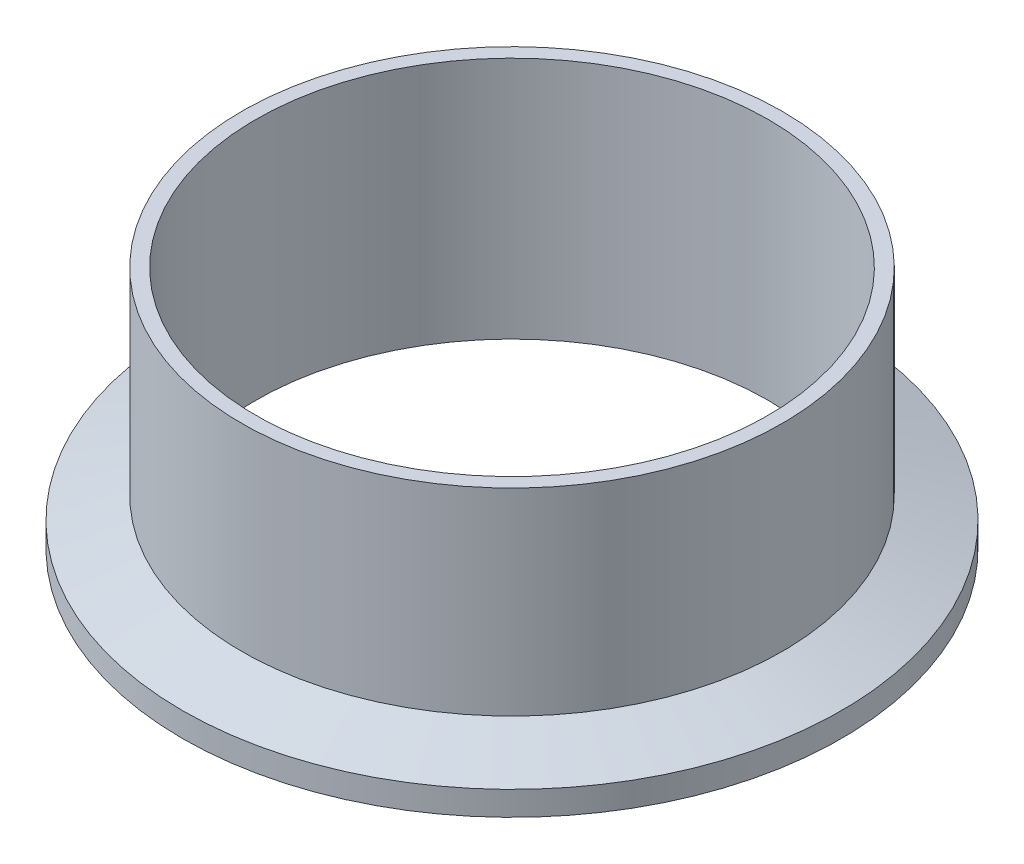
from build123d import *


with BuildPart() as part:
    # Sketch1 → Revolve2 (revolve)
    with BuildSketch(Plane.XY, mode=Mode.PRIVATE) as revolve2_sk:
        with BuildLine():
            Line((-30.099, 0), (-30.099, 28.575))
            Line((-30.099, 28.575), (-31.75, 28.575))
            Line((-31.75, 28.575), (-31.75, 5.377887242))
            Line((-31.75, 5.377887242), (-38.7096, 2.8448))
            Line((-38.7096, 2.8448), (-38.7096, 0))
            Line((-38.7096, 0), (-37.136708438, 0))
            ThreePointArc((-37.136708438, 0), (-36.704511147, 0.129217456), (-36.414166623, 0.474458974))
            ThreePointArc((-36.414166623, 0.474458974), (-35.3187, 1.1938), (-34.223233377, 0.474458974))
            ThreePointArc((-34.223233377, 0.474458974), (-33.932888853, 0.129217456), (-33.500691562, 0))
            Line((-33.500691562, 0), (-30.099, 0))
        make_face()
    revolve(revolve2_sk.sketch.rotate(Axis((0, 0, 0), (0, 1, 0)), 270), axis=Axis((0, 0, 0), (0, 1, 0)))


solid = part.part
